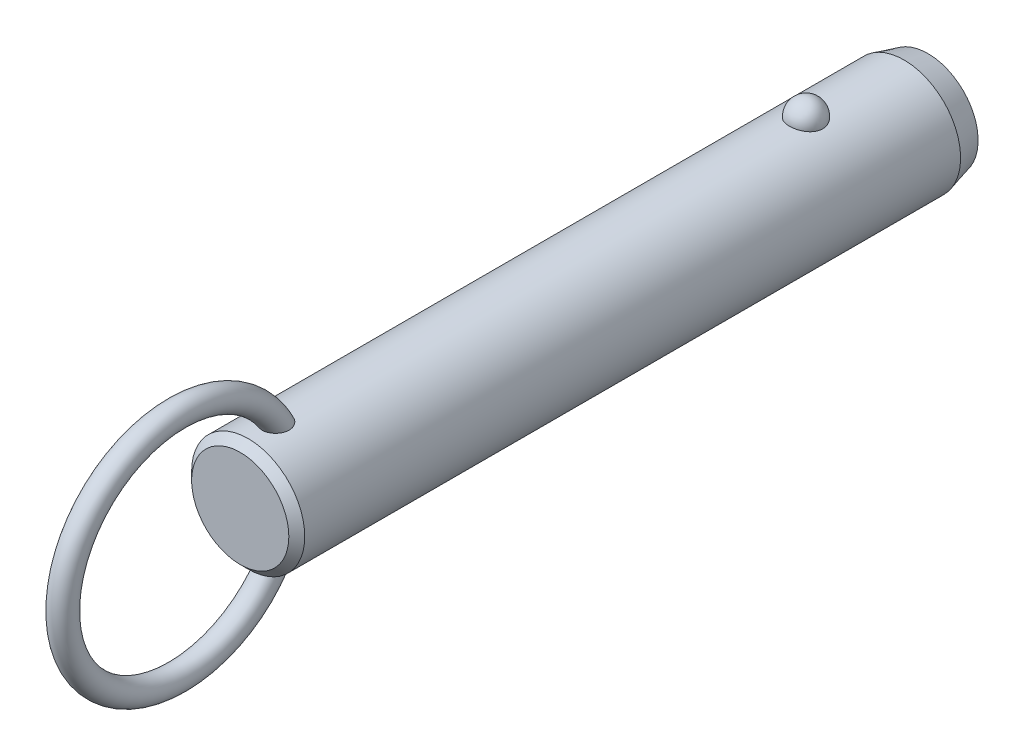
ISO-10303-21;
HEADER;
FILE_DESCRIPTION(('STEP AP214'),'2;1');
FILE_NAME('part.step','',(''),(''),'','','');
FILE_SCHEMA(('AUTOMOTIVE_DESIGN { 1 0 10303 214 1 1 1 1 }'));
ENDSEC;
DATA;
#1=APPLICATION_CONTEXT('core data for automotive mechanical design processes');
#2=APPLICATION_PROTOCOL_DEFINITION('international standard','automotive_design',2000,#1);
#3=PRODUCT_CONTEXT('',#1,'mechanical');
#4=PRODUCT('Part','Part','',(#3));
#5=PRODUCT_RELATED_PRODUCT_CATEGORY('part','',(#4));
#6=PRODUCT_DEFINITION_FORMATION('','',#4);
#7=PRODUCT_DEFINITION_CONTEXT('part definition',#1,'design');
#8=PRODUCT_DEFINITION('design','',#6,#7);
#9=PRODUCT_DEFINITION_SHAPE('','',#8);
#10=(LENGTH_UNIT() NAMED_UNIT(*) SI_UNIT(.MILLI.,.METRE.));
#11=(NAMED_UNIT(*) PLANE_ANGLE_UNIT() SI_UNIT($,.RADIAN.));
#12=(NAMED_UNIT(*) SI_UNIT($,.STERADIAN.) SOLID_ANGLE_UNIT());
#13=UNCERTAINTY_MEASURE_WITH_UNIT(LENGTH_MEASURE(1.E-05),#10,'distance_accuracy_value','');
#14=(GEOMETRIC_REPRESENTATION_CONTEXT(3) GLOBAL_UNCERTAINTY_ASSIGNED_CONTEXT((#13)) GLOBAL_UNIT_ASSIGNED_CONTEXT((#10,
#11,#12)) REPRESENTATION_CONTEXT('',''));
#15=CARTESIAN_POINT('',(0.,0.,0.));
#16=DIRECTION('',(0.,0.,1.));
#17=DIRECTION('',(1.,0.,0.));
#18=AXIS2_PLACEMENT_3D('',#15,#16,#17);
#19=CARTESIAN_POINT('',(0.,0.,61.));
#20=DIRECTION('',(0.,0.,-1.));
#21=DIRECTION('',(-1.,0.,0.));
#22=AXIS2_PLACEMENT_3D('',#19,#20,#21);
#23=CYLINDRICAL_SURFACE('',#22,7.1);
#24=CARTESIAN_POINT('',(2.0769088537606,6.78943661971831,-2.1));
#25=CARTESIAN_POINT('',(2.07690739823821,6.78943796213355,-1.98268154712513));
#26=CARTESIAN_POINT('',(2.06738130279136,6.79237331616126,-1.86534506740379));
#27=CARTESIAN_POINT('',(2.0295040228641,6.8037853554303,-1.63400788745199));
#28=CARTESIAN_POINT('',(2.00114757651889,6.81226358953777,-1.52000812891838));
#29=CARTESIAN_POINT('',(1.92632025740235,6.83379798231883,-1.29863433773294));
#30=CARTESIAN_POINT('',(1.87985726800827,6.84685214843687,-1.19125744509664));
#31=CARTESIAN_POINT('',(1.76995205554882,6.87608091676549,-0.986046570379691));
#32=CARTESIAN_POINT('',(1.70650980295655,6.8922555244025,-0.88821260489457));
#33=CARTESIAN_POINT('',(1.56381192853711,6.92602930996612,-0.704242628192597));
#34=CARTESIAN_POINT('',(1.4844714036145,6.94363582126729,-0.618173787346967));
#35=CARTESIAN_POINT('',(1.31221746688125,6.97823658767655,-0.460740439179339));
#36=CARTESIAN_POINT('',(1.21930409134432,6.99523084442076,-0.389375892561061));
#37=CARTESIAN_POINT('',(1.02268781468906,7.02666176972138,-0.263547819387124));
#38=CARTESIAN_POINT('',(0.919020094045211,7.04110638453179,-0.209031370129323));
#39=CARTESIAN_POINT('',(0.703548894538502,7.06588726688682,-0.118163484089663));
#40=CARTESIAN_POINT('',(0.591746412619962,7.07622403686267,-0.081809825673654));
#41=CARTESIAN_POINT('',(0.365557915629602,7.09147068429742,-0.0288711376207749));
#42=CARTESIAN_POINT('',(0.251267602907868,7.09648447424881,-0.011907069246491));
#43=CARTESIAN_POINT('',(0.0213499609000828,7.10089837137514,0.00304925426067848));
#44=CARTESIAN_POINT('',(-0.0942772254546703,7.10029907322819,0.00104351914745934));
#45=CARTESIAN_POINT('',(-0.321651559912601,7.09360829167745,-0.0216931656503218));
#46=CARTESIAN_POINT('',(-0.433431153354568,7.08760388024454,-0.0421272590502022));
#47=CARTESIAN_POINT('',(-0.651862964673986,7.07086131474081,-0.100729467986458));
#48=CARTESIAN_POINT('',(-0.758515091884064,7.06012307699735,-0.138897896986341));
#49=CARTESIAN_POINT('',(-0.964449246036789,7.03496097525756,-0.232213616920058));
#50=CARTESIAN_POINT('',(-1.06368095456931,7.02051445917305,-0.287465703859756));
#51=CARTESIAN_POINT('',(-1.25145353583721,6.98948740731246,-0.413383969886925));
#52=CARTESIAN_POINT('',(-1.33999321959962,6.97290663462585,-0.484051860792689));
#53=CARTESIAN_POINT('',(-1.50591604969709,6.93898770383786,-0.640594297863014));
#54=CARTESIAN_POINT('',(-1.58302488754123,6.92164094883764,-0.726757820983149));
#55=CARTESIAN_POINT('',(-1.72189320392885,6.8884103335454,-0.910927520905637));
#56=CARTESIAN_POINT('',(-1.78365144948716,6.87252659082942,-1.008934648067));
#57=CARTESIAN_POINT('',(-1.89101272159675,6.84377189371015,-1.21549497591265));
#58=CARTESIAN_POINT('',(-1.93639553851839,6.83094274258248,-1.32416860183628));
#59=CARTESIAN_POINT('',(-2.00874275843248,6.81002070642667,-1.54791500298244));
#60=CARTESIAN_POINT('',(-2.03570774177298,6.80192767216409,-1.66298757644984));
#61=CARTESIAN_POINT('',(-2.07047276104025,6.7914266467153,-1.89571453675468));
#62=CARTESIAN_POINT('',(-2.07835878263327,6.78899315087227,-2.01335491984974));
#63=CARTESIAN_POINT('',(-2.07502083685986,6.79001409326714,-2.24833570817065));
#64=CARTESIAN_POINT('',(-2.06379746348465,6.7934683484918,-2.36567612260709));
#65=CARTESIAN_POINT('',(-2.02263913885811,6.80583442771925,-2.59603194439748));
#66=CARTESIAN_POINT('',(-1.99281127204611,6.81471501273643,-2.70906820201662));
#67=CARTESIAN_POINT('',(-1.91526639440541,6.83691232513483,-2.92836575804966));
#68=CARTESIAN_POINT('',(-1.8675486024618,6.85022924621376,-3.03462676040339));
#69=CARTESIAN_POINT('',(-1.75504492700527,6.87991336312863,-3.23806487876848));
#70=CARTESIAN_POINT('',(-1.69015924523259,6.89629822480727,-3.33518422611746));
#71=CARTESIAN_POINT('',(-1.54505404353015,6.93024852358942,-3.51697105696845));
#72=CARTESIAN_POINT('',(-1.46483385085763,6.94781401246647,-3.60163799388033));
#73=CARTESIAN_POINT('',(-1.29071406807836,6.98225977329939,-3.75654119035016));
#74=CARTESIAN_POINT('',(-1.19675650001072,6.99913673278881,-3.82671308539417));
#75=CARTESIAN_POINT('',(-0.997940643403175,7.03023618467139,-3.9501837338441));
#76=CARTESIAN_POINT('',(-0.893083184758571,7.04445887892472,-4.00348377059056));
#77=CARTESIAN_POINT('',(-0.676902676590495,7.06848365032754,-4.09107242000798));
#78=CARTESIAN_POINT('',(-0.565686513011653,7.0783430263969,-4.12560889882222));
#79=CARTESIAN_POINT('',(-0.338739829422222,7.09282534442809,-4.17575450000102));
#80=CARTESIAN_POINT('',(-0.223009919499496,7.09744899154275,-4.19136617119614));
#81=CARTESIAN_POINT('',(0.00707628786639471,7.10090930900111,-4.20307965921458));
#82=CARTESIAN_POINT('',(0.121410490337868,7.09986531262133,-4.19958377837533));
#83=CARTESIAN_POINT('',(0.347815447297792,7.092380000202,-4.17411564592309));
#84=CARTESIAN_POINT('',(0.459886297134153,7.08593891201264,-4.15214417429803));
#85=CARTESIAN_POINT('',(0.678084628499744,7.06838983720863,-4.09049562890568));
#86=CARTESIAN_POINT('',(0.784237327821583,7.05730369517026,-4.05090137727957));
#87=CARTESIAN_POINT('',(0.988305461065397,7.03163139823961,-3.95511447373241));
#88=CARTESIAN_POINT('',(1.08622031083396,7.01704499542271,-3.89892064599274));
#89=CARTESIAN_POINT('',(1.27284490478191,6.98562668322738,-3.77035541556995));
#90=CARTESIAN_POINT('',(1.36137372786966,6.96876135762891,-3.69772964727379));
#91=CARTESIAN_POINT('',(1.52509486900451,6.93477412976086,-3.53878279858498));
#92=CARTESIAN_POINT('',(1.60028496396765,6.91765218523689,-3.45245943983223));
#93=CARTESIAN_POINT('',(1.73681688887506,6.88465753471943,-3.26658774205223));
#94=CARTESIAN_POINT('',(1.79785966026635,6.86881574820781,-3.1668140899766));
#95=CARTESIAN_POINT('',(1.9026532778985,6.84053157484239,-2.9581440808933));
#96=CARTESIAN_POINT('',(1.94640861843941,6.82808830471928,-2.84925010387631));
#97=CARTESIAN_POINT('',(2.01274378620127,6.80881460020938,-2.63454318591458));
#98=CARTESIAN_POINT('',(2.03676193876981,6.80160856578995,-2.52920574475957));
#99=CARTESIAN_POINT('',(2.06884490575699,6.79191902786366,-2.3159172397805));
#100=CARTESIAN_POINT('',(2.07691019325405,6.78943538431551,-2.20796625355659));
#101=CARTESIAN_POINT('',(2.0769088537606,6.78943661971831,-2.1));
#102=B_SPLINE_CURVE_WITH_KNOTS('',3,(#24,#25,#26,#27,#28,#29,#30,#31,#32,#33,#34,#35,#36,#37,
#38,#39,#40,#41,#42,#43,#44,#45,#46,#47,#48,#49,#50,#51,#52,#53,#54,#55,#56,#57,#58,#59,#60,#61,
#62,#63,#64,#65,#66,#67,#68,#69,#70,#71,#72,#73,#74,#75,#76,#77,#78,#79,#80,#81,#82,#83,#84,#85,
#86,#87,#88,#89,#90,#91,#92,#93,#94,#95,#96,#97,#98,#99,#100,#101),.UNSPECIFIED.,.T.,.F.,(4,2,2,
2,2,2,2,2,2,2,2,2,2,2,2,2,2,2,2,2,2,2,2,2,2,2,2,2,2,2,2,2,2,2,2,2,2,2,4),(0.,0.351568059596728,
0.703234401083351,1.05474780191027,1.40626181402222,1.75970563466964,2.11314851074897,
2.4654696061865,2.81774759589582,3.16301449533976,3.50824481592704,3.84801136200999,
4.18778391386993,4.52968352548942,4.87162112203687,5.22076181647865,5.56993054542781,
5.92363364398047,6.27732559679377,6.62942052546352,6.98150450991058,7.33158042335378,
7.68167162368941,8.03384443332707,8.38603269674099,8.73975272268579,9.09344583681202,
9.44234545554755,9.79119807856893,10.1327344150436,10.4742563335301,10.8141898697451,
11.1541474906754,11.4997793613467,11.8454687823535,12.1979079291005,12.5502553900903,
12.8738073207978,13.1973496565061),.UNSPECIFIED.);
#103=CARTESIAN_POINT('',(2.0769088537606,6.78943661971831,-2.1));
#104=VERTEX_POINT('',#103);
#105=EDGE_CURVE('E41',#104,#104,#102,.T.);
#106=ORIENTED_EDGE('',*,*,#105,.T.);
#107=EDGE_LOOP('',(#106));
#108=FACE_BOUND('',#107,.T.);
#109=CARTESIAN_POINT('',(0.,0.,67.9200000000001));
#110=DIRECTION('',(0.,0.,1.));
#111=DIRECTION('',(1.,0.,0.));
#112=AXIS2_PLACEMENT_3D('',#109,#110,#111);
#113=CIRCLE('',#112,7.1);
#114=CARTESIAN_POINT('',(7.1,0.,67.9200000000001));
#115=VERTEX_POINT('',#114);
#116=EDGE_CURVE('E10',#115,#115,#113,.F.);
#117=ORIENTED_EDGE('',*,*,#116,.T.);
#118=EDGE_LOOP('',(#117));
#119=FACE_BOUND('',#118,.T.);
#120=CARTESIAN_POINT('',(-0.429539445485,-7.08699541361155,62.7429212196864));
#121=CARTESIAN_POINT('',(-0.508331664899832,-7.08221999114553,62.7668764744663));
#122=CARTESIAN_POINT('',(-0.58503984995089,-7.07624016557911,62.7974570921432));
#123=CARTESIAN_POINT('',(-0.732082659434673,-7.06254296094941,62.8710242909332));
#124=CARTESIAN_POINT('',(-0.802417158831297,-7.05482554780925,62.9140111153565));
#125=CARTESIAN_POINT('',(-0.934722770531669,-7.03851844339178,63.0111135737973));
#126=CARTESIAN_POINT('',(-0.99670020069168,-7.02992941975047,63.0652207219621));
#127=CARTESIAN_POINT('',(-1.11079942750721,-7.01280697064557,63.1829676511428));
#128=CARTESIAN_POINT('',(-1.16292136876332,-7.00427354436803,63.2466072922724));
#129=CARTESIAN_POINT('',(-1.25705660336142,-6.98799959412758,63.3826870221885));
#130=CARTESIAN_POINT('',(-1.29888032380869,-6.98027525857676,63.4552598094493));
#131=CARTESIAN_POINT('',(-1.37069920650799,-6.96652886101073,63.6061686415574));
#132=CARTESIAN_POINT('',(-1.40069157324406,-6.96050720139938,63.6845060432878));
#133=CARTESIAN_POINT('',(-1.45043507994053,-6.95031881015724,63.8501903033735));
#134=CARTESIAN_POINT('',(-1.46937115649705,-6.94630231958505,63.9377897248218));
#135=CARTESIAN_POINT('',(-1.49424917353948,-6.94099239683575,64.1148714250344));
#136=CARTESIAN_POINT('',(-1.50018601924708,-6.93970003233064,64.2043544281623));
#137=CARTESIAN_POINT('',(-1.49978214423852,-6.93978815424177,64.3940607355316));
#138=CARTESIAN_POINT('',(-1.49187639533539,-6.94150934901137,64.494279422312));
#139=CARTESIAN_POINT('',(-1.46177925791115,-6.94790814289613,64.6924798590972));
#140=CARTESIAN_POINT('',(-1.43957541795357,-6.95258831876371,64.790459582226));
#141=CARTESIAN_POINT('',(-1.37783293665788,-6.96510647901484,64.9953629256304));
#142=CARTESIAN_POINT('',(-1.33634073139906,-6.97328848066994,65.1016801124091));
#143=CARTESIAN_POINT('',(-1.23686994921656,-6.99161706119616,65.3061777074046));
#144=CARTESIAN_POINT('',(-1.17889192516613,-7.00176357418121,65.4043583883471));
#145=CARTESIAN_POINT('',(-1.0587512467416,-7.02082898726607,65.5723743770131));
#146=CARTESIAN_POINT('',(-0.999247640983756,-7.02963746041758,65.6441230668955));
#147=CARTESIAN_POINT('',(-0.869494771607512,-7.04686074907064,65.7771959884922));
#148=CARTESIAN_POINT('',(-0.799263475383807,-7.05527619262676,65.8385372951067));
#149=CARTESIAN_POINT('',(-0.665408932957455,-7.06899457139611,65.9351316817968));
#150=CARTESIAN_POINT('',(-0.603817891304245,-7.07457275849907,65.9731512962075));
#151=CARTESIAN_POINT('',(-0.47517283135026,-7.08437420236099,66.0387581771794));
#152=CARTESIAN_POINT('',(-0.408123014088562,-7.08859848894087,66.0663533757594));
#153=CARTESIAN_POINT('',(-0.269431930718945,-7.09522749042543,66.1092569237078));
#154=CARTESIAN_POINT('',(-0.197757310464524,-7.09761688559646,66.1244618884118));
#155=CARTESIAN_POINT('',(-0.0527849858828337,-7.10017268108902,66.1407168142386));
#156=CARTESIAN_POINT('',(0.0205115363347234,-7.10034065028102,66.1417767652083));
#157=CARTESIAN_POINT('',(0.15642613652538,-7.09855986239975,66.1304619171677));
#158=CARTESIAN_POINT('',(0.219199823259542,-7.09688191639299,66.1198060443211));
#159=CARTESIAN_POINT('',(0.342134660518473,-7.09201880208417,66.0885379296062));
#160=CARTESIAN_POINT('',(0.402295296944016,-7.08883333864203,66.0679237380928));
#161=CARTESIAN_POINT('',(0.520687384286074,-7.08113868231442,66.0172125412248));
#162=CARTESIAN_POINT('',(0.578791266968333,-7.07658958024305,65.9868272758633));
#163=CARTESIAN_POINT('',(0.690173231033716,-7.06659708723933,65.9183678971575));
#164=CARTESIAN_POINT('',(0.743447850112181,-7.061153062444,65.8802883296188));
#165=CARTESIAN_POINT('',(0.870947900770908,-7.04680292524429,65.7765929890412));
#166=CARTESIAN_POINT('',(0.941828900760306,-7.0375580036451,65.7068972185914));
#167=CARTESIAN_POINT('',(1.07136606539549,-7.01900793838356,65.5569450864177));
#168=CARTESIAN_POINT('',(1.13000013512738,-7.00970271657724,65.4766700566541));
#169=CARTESIAN_POINT('',(1.23579584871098,-6.99183327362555,65.3068997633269));
#170=CARTESIAN_POINT('',(1.2827427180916,-6.98328455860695,65.2172696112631));
#171=CARTESIAN_POINT('',(1.36351442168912,-6.96796352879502,65.0321763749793));
#172=CARTESIAN_POINT('',(1.39733971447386,-6.96119115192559,64.9367134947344));
#173=CARTESIAN_POINT('',(1.45579181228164,-6.94922464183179,64.7253092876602));
#174=CARTESIAN_POINT('',(1.47790145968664,-6.94449000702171,64.608631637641));
#175=CARTESIAN_POINT('',(1.50168752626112,-6.93938731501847,64.3730153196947));
#176=CARTESIAN_POINT('',(1.50336085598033,-6.93901991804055,64.2540763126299));
#177=CARTESIAN_POINT('',(1.48486516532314,-6.9430010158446,64.0236079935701));
#178=CARTESIAN_POINT('',(1.46573441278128,-6.9471253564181,63.911995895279));
#179=CARTESIAN_POINT('',(1.40606892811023,-6.95944667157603,63.6948868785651));
#180=CARTESIAN_POINT('',(1.36556446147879,-6.96763788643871,63.5893815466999));
#181=CARTESIAN_POINT('',(1.27082700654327,-6.98548038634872,63.4042879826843));
#182=CARTESIAN_POINT('',(1.21949810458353,-6.99473841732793,63.3231719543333));
#183=CARTESIAN_POINT('',(1.10242050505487,-7.01414069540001,63.1722278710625));
#184=CARTESIAN_POINT('',(1.03668119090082,-7.02428436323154,63.1023925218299));
#185=CARTESIAN_POINT('',(0.900559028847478,-7.04295285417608,62.9835735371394));
#186=CARTESIAN_POINT('',(0.83142884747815,-7.05153466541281,62.9331573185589));
#187=CARTESIAN_POINT('',(0.68529187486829,-7.06723150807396,62.8451429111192));
#188=CARTESIAN_POINT('',(0.608287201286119,-7.0743469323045,62.8075412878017));
#189=CARTESIAN_POINT('',(0.451878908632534,-7.08602232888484,62.7474915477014));
#190=CARTESIAN_POINT('',(0.372686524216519,-7.09067127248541,62.7245088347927));
#191=CARTESIAN_POINT('',(0.211477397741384,-7.09730788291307,62.6920357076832));
#192=CARTESIAN_POINT('',(0.129460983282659,-7.09929585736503,62.6825437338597));
#193=CARTESIAN_POINT('',(-0.0332905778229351,-7.10037858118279,62.6773517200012));
#194=CARTESIAN_POINT('',(-0.11401636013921,-7.09953334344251,62.6813656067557));
#195=CARTESIAN_POINT('',(-0.273670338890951,-7.09517338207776,62.7024540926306));
#196=CARTESIAN_POINT('',(-0.352598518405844,-7.09165863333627,62.7195288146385));
#197=CARTESIAN_POINT('',(-0.429539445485,-7.08699541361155,62.7429212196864));
#198=B_SPLINE_CURVE_WITH_KNOTS('',3,(#120,#121,#122,#123,#124,#125,#126,#127,#128,#129,#130,
#131,#132,#133,#134,#135,#136,#137,#138,#139,#140,#141,#142,#143,#144,#145,#146,#147,#148,#149,
#150,#151,#152,#153,#154,#155,#156,#157,#158,#159,#160,#161,#162,#163,#164,#165,#166,#167,#168,
#169,#170,#171,#172,#173,#174,#175,#176,#177,#178,#179,#180,#181,#182,#183,#184,#185,#186,#187,
#188,#189,#190,#191,#192,#193,#194,#195,#196,#197),.UNSPECIFIED.,.T.,.F.,(4,2,2,2,2,2,2,2,2,2,2,
2,2,2,2,2,2,2,2,2,2,2,2,2,2,2,2,2,2,2,2,2,2,2,2,2,2,2,4),(0.,0.247183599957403,
0.494372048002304,0.741372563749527,0.988369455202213,1.23962059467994,1.49093106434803,
1.75897818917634,2.02713035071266,2.3275826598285,2.62829697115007,2.97008736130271,
3.31186629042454,3.59175319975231,3.87117637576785,4.08813841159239,4.30493502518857,
4.52352259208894,4.74195577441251,4.9321532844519,5.12238804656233,5.31884850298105,
5.51544871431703,5.81332317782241,6.11173048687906,6.4152726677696,6.71880423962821,
7.073581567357,7.42841252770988,7.76631485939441,8.10373999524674,8.3914224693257,
8.67891817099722,8.93560332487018,9.19221962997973,9.43881106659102,9.68537399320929,
9.92674752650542,10.1681233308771),.UNSPECIFIED.);
#199=CARTESIAN_POINT('',(-0.429539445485,-7.08699541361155,62.7429212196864));
#200=VERTEX_POINT('',#199);
#201=EDGE_CURVE('E60',#200,#200,#198,.T.);
#202=ORIENTED_EDGE('',*,*,#201,.T.);
#203=EDGE_LOOP('',(#202));
#204=FACE_BOUND('',#203,.T.);
#205=CARTESIAN_POINT('',(-0.429539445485,7.08699541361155,62.7429212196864));
#206=CARTESIAN_POINT('',(-0.351665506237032,7.09171429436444,62.7192469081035));
#207=CARTESIAN_POINT('',(-0.271733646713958,7.09525896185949,62.7020369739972));
#208=CARTESIAN_POINT('',(-0.110026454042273,7.09960839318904,62.6810059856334));
#209=CARTESIAN_POINT('',(-0.0282502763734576,7.10041187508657,62.677191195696));
#210=CARTESIAN_POINT('',(0.134782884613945,7.09918849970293,62.683059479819));
#211=CARTESIAN_POINT('',(0.216039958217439,7.09716214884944,62.6927401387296));
#212=CARTESIAN_POINT('',(0.375730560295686,7.09050177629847,62.7253471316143));
#213=CARTESIAN_POINT('',(0.454164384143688,7.08586802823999,62.7482720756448));
#214=CARTESIAN_POINT('',(0.606025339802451,7.07449911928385,62.806771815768));
#215=CARTESIAN_POINT('',(0.679451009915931,7.06776334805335,62.8423502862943));
#216=CARTESIAN_POINT('',(0.819234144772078,7.05292866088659,62.9251753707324));
#217=CARTESIAN_POINT('',(0.88559181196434,7.04482978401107,62.9724216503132));
#218=CARTESIAN_POINT('',(1.00993211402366,7.02808709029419,63.0775902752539));
#219=CARTESIAN_POINT('',(1.06785399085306,7.01943990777,63.135583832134));
#220=CARTESIAN_POINT('',(1.17342527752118,7.00256662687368,63.2603013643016));
#221=CARTESIAN_POINT('',(1.22107408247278,6.99434055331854,63.3270258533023));
#222=CARTESIAN_POINT('',(1.30652927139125,6.97889183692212,63.4693622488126));
#223=CARTESIAN_POINT('',(1.34399711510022,6.97170674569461,63.5451808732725));
#224=CARTESIAN_POINT('',(1.40682616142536,6.95930080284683,63.7018100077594));
#225=CARTESIAN_POINT('',(1.43218374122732,6.95408053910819,63.7826220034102));
#226=CARTESIAN_POINT('',(1.47246409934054,6.94566853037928,63.9535314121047));
#227=CARTESIAN_POINT('',(1.48642590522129,6.9426653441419,64.0438630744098));
#228=CARTESIAN_POINT('',(1.5011410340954,6.93949744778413,64.225619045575));
#229=CARTESIAN_POINT('',(1.50188917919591,6.93933385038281,64.3170437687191));
#230=CARTESIAN_POINT('',(1.49030464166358,6.94183245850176,64.5108438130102));
#231=CARTESIAN_POINT('',(1.47627413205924,6.94486147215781,64.613112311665));
#232=CARTESIAN_POINT('',(1.43356351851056,6.95380194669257,64.8144719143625));
#233=CARTESIAN_POINT('',(1.4048676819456,6.95971650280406,64.9135594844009));
#234=CARTESIAN_POINT('',(1.32908750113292,6.97461208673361,65.1189087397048));
#235=CARTESIAN_POINT('',(1.28011435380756,6.98388945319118,65.2244566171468));
#236=CARTESIAN_POINT('',(1.16520357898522,7.00397743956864,65.4257604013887));
#237=CARTESIAN_POINT('',(1.09927694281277,7.01478706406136,65.5215225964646));
#238=CARTESIAN_POINT('',(0.969361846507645,7.03373936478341,65.6767565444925));
#239=CARTESIAN_POINT('',(0.909042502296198,7.04187023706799,65.7393032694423));
#240=CARTESIAN_POINT('',(0.77917855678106,7.0574173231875,65.8540535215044));
#241=CARTESIAN_POINT('',(0.70964977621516,7.06483472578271,65.9062744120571));
#242=CARTESIAN_POINT('',(0.576854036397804,7.0767751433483,65.9881138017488));
#243=CARTESIAN_POINT('',(0.515118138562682,7.08158033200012,66.0201641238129));
#244=CARTESIAN_POINT('',(0.387127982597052,7.08972701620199,66.0737656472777));
#245=CARTESIAN_POINT('',(0.320877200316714,7.09306962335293,66.0953248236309));
#246=CARTESIAN_POINT('',(0.185041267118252,7.09791507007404,66.1264005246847));
#247=CARTESIAN_POINT('',(0.115437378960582,7.09940591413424,66.1358385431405));
#248=CARTESIAN_POINT('',(-0.0243157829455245,7.10030171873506,66.1415226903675));
#249=CARTESIAN_POINT('',(-0.094464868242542,7.0997073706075,66.1377731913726));
#250=CARTESIAN_POINT('',(-0.225713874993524,7.09668414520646,66.1185081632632));
#251=CARTESIAN_POINT('',(-0.287006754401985,7.09444865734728,66.1042323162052));
#252=CARTESIAN_POINT('',(-0.406555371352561,7.08860360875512,66.0663685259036));
#253=CARTESIAN_POINT('',(-0.464809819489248,7.08499346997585,66.0427766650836));
#254=CARTESIAN_POINT('',(-0.594955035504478,7.07541654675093,65.9789232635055));
#255=CARTESIAN_POINT('',(-0.665389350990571,7.06906574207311,65.935753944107));
#256=CARTESIAN_POINT('',(-0.798242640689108,7.05530261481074,65.838587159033));
#257=CARTESIAN_POINT('',(-0.860645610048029,7.0478882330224,65.7845686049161));
#258=CARTESIAN_POINT('',(-0.994249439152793,7.03045217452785,65.6509965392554));
#259=CARTESIAN_POINT('',(-1.06260129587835,7.02030745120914,65.5686143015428));
#260=CARTESIAN_POINT('',(-1.18502045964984,7.00068382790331,65.393843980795));
#261=CARTESIAN_POINT('',(-1.23907684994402,6.99120544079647,65.301448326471));
#262=CARTESIAN_POINT('',(-1.33335589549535,6.97384343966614,65.1080085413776));
#263=CARTESIAN_POINT('',(-1.37336138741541,6.96598557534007,65.0068564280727));
#264=CARTESIAN_POINT('',(-1.43770677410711,6.9529905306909,64.7995046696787));
#265=CARTESIAN_POINT('',(-1.46204473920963,6.94785368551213,64.69330440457));
#266=CARTESIAN_POINT('',(-1.49537533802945,6.94076296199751,64.4682317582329));
#267=CARTESIAN_POINT('',(-1.50273564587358,6.93914842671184,64.34909751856));
#268=CARTESIAN_POINT('',(-1.4954555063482,6.94072368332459,64.1114703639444));
#269=CARTESIAN_POINT('',(-1.48082914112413,6.94391040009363,63.9929770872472));
#270=CARTESIAN_POINT('',(-1.43076401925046,6.95438579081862,63.7734325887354));
#271=CARTESIAN_POINT('',(-1.39762227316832,6.96121852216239,63.6718413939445));
#272=CARTESIAN_POINT('',(-1.31211274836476,6.97783941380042,63.4773513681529));
#273=CARTESIAN_POINT('',(-1.2597660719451,6.98762432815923,63.3844431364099));
#274=CARTESIAN_POINT('',(-1.14583073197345,7.00713153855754,63.2241601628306));
#275=CARTESIAN_POINT('',(-1.0866594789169,7.01665982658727,63.1550351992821));
#276=CARTESIAN_POINT('',(-0.956606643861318,7.03556646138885,63.0288786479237));
#277=CARTESIAN_POINT('',(-0.885737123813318,7.04494495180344,62.9718347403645));
#278=CARTESIAN_POINT('',(-0.751558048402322,7.06035735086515,62.8831004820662));
#279=CARTESIAN_POINT('',(-0.690120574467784,7.0666695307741,62.8485932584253));
#280=CARTESIAN_POINT('',(-0.562815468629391,7.07794609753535,62.7887507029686));
#281=CARTESIAN_POINT('',(-0.496948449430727,7.08291067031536,62.7634141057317));
#282=CARTESIAN_POINT('',(-0.429539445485,7.08699541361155,62.7429212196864));
#283=B_SPLINE_CURVE_WITH_KNOTS('',3,(#205,#206,#207,#208,#209,#210,#211,#212,#213,#214,#215,
#216,#217,#218,#219,#220,#221,#222,#223,#224,#225,#226,#227,#228,#229,#230,#231,#232,#233,#234,
#235,#236,#237,#238,#239,#240,#241,#242,#243,#244,#245,#246,#247,#248,#249,#250,#251,#252,#253,
#254,#255,#256,#257,#258,#259,#260,#261,#262,#263,#264,#265,#266,#267,#268,#269,#270,#271,#272,
#273,#274,#275,#276,#277,#278,#279,#280,#281,#282),.UNSPECIFIED.,.T.,.F.,(4,2,2,2,2,2,2,2,2,2,2,
2,2,2,2,2,2,2,2,2,2,2,2,2,2,2,2,2,2,2,2,2,2,2,2,2,2,2,4),(0.,0.244335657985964,
0.488785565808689,0.733191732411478,0.977572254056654,1.22202379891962,1.46646834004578,
1.71259457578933,1.95873529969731,2.21226768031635,2.46587585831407,2.7391381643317,
3.01250754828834,3.32109936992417,3.63002293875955,3.97863512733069,4.32702187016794,
4.5879394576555,4.84841449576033,5.05676704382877,5.26496096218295,5.47449661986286,
5.68396281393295,5.87205447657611,6.06022532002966,6.30743751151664,6.55513496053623,
6.87602468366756,7.19715875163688,7.52305774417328,7.84899686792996,8.20516155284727,
8.56109821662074,8.88040084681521,9.19935367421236,9.47236282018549,9.74509220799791,
9.95662250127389,10.1681235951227),.UNSPECIFIED.);
#284=CARTESIAN_POINT('',(-0.429539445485,7.08699541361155,62.7429212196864));
#285=VERTEX_POINT('',#284);
#286=EDGE_CURVE('E67',#285,#285,#283,.T.);
#287=ORIENTED_EDGE('',*,*,#286,.T.);
#288=EDGE_LOOP('',(#287));
#289=FACE_BOUND('',#288,.T.);
#290=CARTESIAN_POINT('',(0.,0.,-14.4000000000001));
#291=DIRECTION('',(0.,0.,-1.));
#292=DIRECTION('',(-1.,0.,0.));
#293=AXIS2_PLACEMENT_3D('',#290,#291,#292);
#294=CIRCLE('',#293,7.1);
#295=CARTESIAN_POINT('',(-7.1,0.,-14.4000000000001));
#296=VERTEX_POINT('',#295);
#297=EDGE_CURVE('E57',#296,#296,#294,.F.);
#298=ORIENTED_EDGE('',*,*,#297,.T.);
#299=EDGE_LOOP('',(#298));
#300=FACE_BOUND('',#299,.T.);
#301=ADVANCED_FACE('F37',(#108,#119,#204,#289,#300),#23,.T.);
#302=CARTESIAN_POINT('',(0.,0.,-17.4));
#303=DIRECTION('',(0.,0.,-1.));
#304=DIRECTION('',(-1.,0.,0.));
#305=AXIS2_PLACEMENT_3D('',#302,#303,#304);
#306=PLANE('',#305);
#307=CARTESIAN_POINT('',(0.,0.,-17.4));
#308=DIRECTION('',(0.,0.,-1.));
#309=DIRECTION('',(-1.,0.,0.));
#310=AXIS2_PLACEMENT_3D('',#307,#308,#309);
#311=CIRCLE('',#310,6.29615242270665);
#312=CARTESIAN_POINT('',(-6.29615242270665,0.,-17.4));
#313=VERTEX_POINT('',#312);
#314=EDGE_CURVE('E66',#313,#313,#311,.T.);
#315=ORIENTED_EDGE('',*,*,#314,.T.);
#316=EDGE_LOOP('',(#315));
#317=FACE_BOUND('',#316,.T.);
#318=ADVANCED_FACE('F85',(#317),#306,.T.);
#319=CARTESIAN_POINT('',(0.,0.,-17.4));
#320=DIRECTION('',(0.,0.,1.));
#321=DIRECTION('',(1.,0.,0.));
#322=AXIS2_PLACEMENT_3D('',#319,#320,#321);
#323=CONICAL_SURFACE('',#322,6.29615242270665,0.26179938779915);
#324=ORIENTED_EDGE('',*,*,#297,.F.);
#325=EDGE_LOOP('',(#324));
#326=FACE_BOUND('',#325,.T.);
#327=ORIENTED_EDGE('',*,*,#314,.F.);
#328=EDGE_LOOP('',(#327));
#329=FACE_BOUND('',#328,.T.);
#330=ADVANCED_FACE('F83',(#326,#329),#323,.T.);
#331=CARTESIAN_POINT('',(0.,0.,68.92));
#332=DIRECTION('',(0.,0.,1.));
#333=DIRECTION('',(1.,0.,0.));
#334=AXIS2_PLACEMENT_3D('',#331,#332,#333);
#335=PLANE('',#334);
#336=CARTESIAN_POINT('',(0.,0.,68.92));
#337=DIRECTION('',(0.,0.,1.));
#338=DIRECTION('',(1.,0.,0.));
#339=AXIS2_PLACEMENT_3D('',#336,#337,#338);
#340=CIRCLE('',#339,6.10000000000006);
#341=CARTESIAN_POINT('',(6.10000000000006,0.,68.92));
#342=VERTEX_POINT('',#341);
#343=EDGE_CURVE('E50',#342,#342,#340,.T.);
#344=ORIENTED_EDGE('',*,*,#343,.T.);
#345=EDGE_LOOP('',(#344));
#346=FACE_BOUND('',#345,.T.);
#347=ADVANCED_FACE('F77',(#346),#335,.T.);
#348=CARTESIAN_POINT('',(0.,0.,76.85));
#349=DIRECTION('',(1.,0.,0.));
#350=DIRECTION('',(0.,0.,-1.));
#351=AXIS2_PLACEMENT_3D('',#348,#349,#350);
#352=TOROIDAL_SURFACE('',#351,14.35,1.5);
#353=ORIENTED_EDGE('',*,*,#286,.F.);
#354=EDGE_LOOP('',(#353));
#355=FACE_BOUND('',#354,.T.);
#356=ORIENTED_EDGE('',*,*,#201,.F.);
#357=EDGE_LOOP('',(#356));
#358=FACE_BOUND('',#357,.T.);
#359=ADVANCED_FACE('F73',(#355,#358),#352,.T.);
#360=CARTESIAN_POINT('',(0.,0.,68.92));
#361=DIRECTION('',(0.,0.,-1.));
#362=DIRECTION('',(-1.,0.,0.));
#363=AXIS2_PLACEMENT_3D('',#360,#361,#362);
#364=CONICAL_SURFACE('',#363,6.10000000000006,0.785398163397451);
#365=ORIENTED_EDGE('',*,*,#116,.F.);
#366=EDGE_LOOP('',(#365));
#367=FACE_BOUND('',#366,.T.);
#368=ORIENTED_EDGE('',*,*,#343,.F.);
#369=EDGE_LOOP('',(#368));
#370=FACE_BOUND('',#369,.T.);
#371=ADVANCED_FACE('F39',(#367,#370),#364,.T.);
#372=CARTESIAN_POINT('',(0.,7.1,-2.1));
#373=DIRECTION('',(0.,1.,0.));
#374=DIRECTION('',(0.,0.,1.));
#375=AXIS2_PLACEMENT_3D('',#372,#373,#374);
#376=SPHERICAL_SURFACE('',#375,2.10000000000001);
#377=ORIENTED_EDGE('',*,*,#105,.F.);
#378=EDGE_LOOP('',(#377));
#379=FACE_BOUND('',#378,.T.);
#380=ADVANCED_FACE('F79',(#379),#376,.T.);
#381=CLOSED_SHELL('',(#301,#318,#330,#347,#359,#371,#380));
#382=MANIFOLD_SOLID_BREP('B2',#381);
#383=ADVANCED_BREP_SHAPE_REPRESENTATION('',(#18,#382),#14);
#384=SHAPE_DEFINITION_REPRESENTATION(#9,#383);
ENDSEC;
END-ISO-10303-21;
